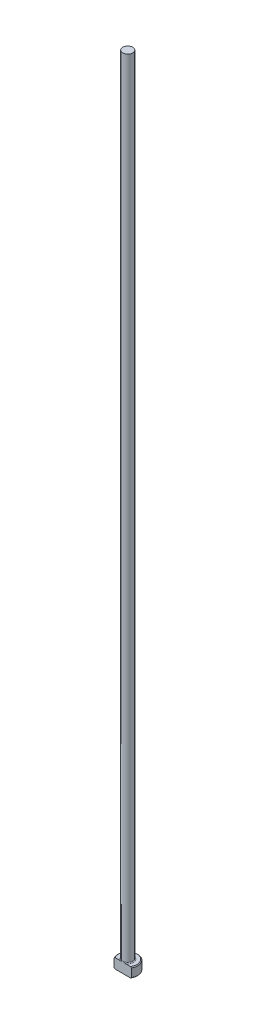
ISO-10303-21;
HEADER;
FILE_DESCRIPTION(('STEP AP214'),'2;1');
FILE_NAME('part.step','',(''),(''),'','','');
FILE_SCHEMA(('AUTOMOTIVE_DESIGN { 1 0 10303 214 1 1 1 1 }'));
ENDSEC;
DATA;
#1=APPLICATION_CONTEXT('core data for automotive mechanical design processes');
#2=APPLICATION_PROTOCOL_DEFINITION('international standard','automotive_design',2000,#1);
#3=PRODUCT_CONTEXT('',#1,'mechanical');
#4=PRODUCT('Part','Part','',(#3));
#5=PRODUCT_RELATED_PRODUCT_CATEGORY('part','',(#4));
#6=PRODUCT_DEFINITION_FORMATION('','',#4);
#7=PRODUCT_DEFINITION_CONTEXT('part definition',#1,'design');
#8=PRODUCT_DEFINITION('design','',#6,#7);
#9=PRODUCT_DEFINITION_SHAPE('','',#8);
#10=(LENGTH_UNIT() NAMED_UNIT(*) SI_UNIT(.MILLI.,.METRE.));
#11=(NAMED_UNIT(*) PLANE_ANGLE_UNIT() SI_UNIT($,.RADIAN.));
#12=(NAMED_UNIT(*) SI_UNIT($,.STERADIAN.) SOLID_ANGLE_UNIT());
#13=UNCERTAINTY_MEASURE_WITH_UNIT(LENGTH_MEASURE(1.E-05),#10,'distance_accuracy_value','');
#14=(GEOMETRIC_REPRESENTATION_CONTEXT(3) GLOBAL_UNCERTAINTY_ASSIGNED_CONTEXT((#13)) GLOBAL_UNIT_ASSIGNED_CONTEXT((#10,
#11,#12)) REPRESENTATION_CONTEXT('',''));
#15=CARTESIAN_POINT('',(0.,0.,0.));
#16=DIRECTION('',(0.,0.,1.));
#17=DIRECTION('',(1.,0.,0.));
#18=AXIS2_PLACEMENT_3D('',#15,#16,#17);
#19=CARTESIAN_POINT('',(0.,0.,0.));
#20=DIRECTION('',(0.,-1.,0.));
#21=DIRECTION('',(0.,0.,-1.));
#22=AXIS2_PLACEMENT_3D('',#19,#20,#21);
#23=PLANE('',#22);
#24=DIRECTION('',(1.,0.,0.));
#25=VECTOR('',#24,1.);
#26=CARTESIAN_POINT('',(-2.74963065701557,0.,1.58749999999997));
#27=LINE('',#26,#25);
#28=CARTESIAN_POINT('',(-2.45195529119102,0.,1.58749999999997));
#29=VERTEX_POINT('',#28);
#30=CARTESIAN_POINT('',(2.45195529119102,0.,1.58749999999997));
#31=VERTEX_POINT('',#30);
#32=EDGE_CURVE('E92',#29,#31,#27,.T.);
#33=ORIENTED_EDGE('',*,*,#32,.F.);
#34=CARTESIAN_POINT('',(0.,0.,0.));
#35=DIRECTION('',(0.,-1.,0.));
#36=DIRECTION('',(0.,0.,-1.));
#37=AXIS2_PLACEMENT_3D('',#34,#35,#36);
#38=CIRCLE('',#37,2.92099999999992);
#39=EDGE_CURVE('E105',#29,#31,#38,.T.);
#40=ORIENTED_EDGE('',*,*,#39,.T.);
#41=EDGE_LOOP('',(#33,#40));
#42=FACE_BOUND('',#41,.T.);
#43=ADVANCED_FACE('F37',(#42),#23,.T.);
#44=CARTESIAN_POINT('',(0.,259.958771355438,0.));
#45=DIRECTION('',(0.,1.,0.));
#46=DIRECTION('',(0.,0.,1.));
#47=AXIS2_PLACEMENT_3D('',#44,#45,#46);
#48=CYLINDRICAL_SURFACE('',#47,3.17499999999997);
#49=DIRECTION('',(0.,-1.,0.));
#50=VECTOR('',#49,1.);
#51=CARTESIAN_POINT('',(-2.74963065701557,254.,1.58749999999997));
#52=LINE('',#51,#50);
#53=CARTESIAN_POINT('',(-2.74963065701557,2.92100000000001,1.58749999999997));
#54=VERTEX_POINT('',#53);
#55=CARTESIAN_POINT('',(-2.74963065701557,0.254000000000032,1.58749999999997));
#56=VERTEX_POINT('',#55);
#57=EDGE_CURVE('E95',#54,#56,#52,.T.);
#58=ORIENTED_EDGE('',*,*,#57,.F.);
#59=CARTESIAN_POINT('',(0.,2.92100000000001,0.));
#60=DIRECTION('',(0.,1.,0.));
#61=DIRECTION('',(0.,0.,1.));
#62=AXIS2_PLACEMENT_3D('',#59,#60,#61);
#63=CIRCLE('',#62,3.17499999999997);
#64=CARTESIAN_POINT('',(2.74963065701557,2.92100000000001,1.58749999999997));
#65=VERTEX_POINT('',#64);
#66=EDGE_CURVE('E109',#54,#65,#63,.F.);
#67=ORIENTED_EDGE('',*,*,#66,.T.);
#68=DIRECTION('',(0.,-1.,0.));
#69=VECTOR('',#68,1.);
#70=CARTESIAN_POINT('',(2.74963065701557,254.,1.58749999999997));
#71=LINE('',#70,#69);
#72=CARTESIAN_POINT('',(2.74963065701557,0.254000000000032,1.58749999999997));
#73=VERTEX_POINT('',#72);
#74=EDGE_CURVE('E187',#65,#73,#71,.T.);
#75=ORIENTED_EDGE('',*,*,#74,.T.);
#76=CARTESIAN_POINT('',(0.,0.254000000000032,0.));
#77=DIRECTION('',(0.,-1.,0.));
#78=DIRECTION('',(0.,0.,-1.));
#79=AXIS2_PLACEMENT_3D('',#76,#77,#78);
#80=CIRCLE('',#79,3.17499999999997);
#81=EDGE_CURVE('E115',#73,#56,#80,.F.);
#82=ORIENTED_EDGE('',*,*,#81,.T.);
#83=EDGE_LOOP('',(#58,#67,#75,#82));
#84=FACE_BOUND('',#83,.T.);
#85=ADVANCED_FACE('F160',(#84),#48,.T.);
#86=CARTESIAN_POINT('',(-3.17499999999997,3.175,0.));
#87=DIRECTION('',(0.,1.,0.));
#88=DIRECTION('',(0.,0.,1.));
#89=AXIS2_PLACEMENT_3D('',#86,#87,#88);
#90=PLANE('',#89);
#91=DIRECTION('',(-1.,0.,0.));
#92=VECTOR('',#91,1.);
#93=CARTESIAN_POINT('',(-3.17499999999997,3.175,1.58749999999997));
#94=LINE('',#93,#92);
#95=CARTESIAN_POINT('',(2.45195529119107,3.175,1.58749999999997));
#96=VERTEX_POINT('',#95);
#97=CARTESIAN_POINT('',(0.933255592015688,3.175,1.58749999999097));
#98=VERTEX_POINT('',#97);
#99=EDGE_CURVE('E58',#96,#98,#94,.T.);
#100=ORIENTED_EDGE('',*,*,#99,.F.);
#101=CARTESIAN_POINT('',(0.,3.175,0.));
#102=DIRECTION('',(0.,1.,0.));
#103=DIRECTION('',(0.,0.,1.));
#104=AXIS2_PLACEMENT_3D('',#101,#102,#103);
#105=CIRCLE('',#104,2.92099999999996);
#106=CARTESIAN_POINT('',(-2.45195529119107,3.175,1.58749999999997));
#107=VERTEX_POINT('',#106);
#108=EDGE_CURVE('E182',#96,#107,#105,.T.);
#109=ORIENTED_EDGE('',*,*,#108,.T.);
#110=CARTESIAN_POINT('',(-0.933255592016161,3.17500000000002,1.58749999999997));
#111=VERTEX_POINT('',#110);
#112=EDGE_CURVE('E140',#111,#107,#94,.T.);
#113=ORIENTED_EDGE('',*,*,#112,.F.);
#114=CARTESIAN_POINT('',(0.,3.175,0.));
#115=DIRECTION('',(0.,1.,0.));
#116=DIRECTION('',(0.,0.,1.));
#117=AXIS2_PLACEMENT_3D('',#114,#115,#116);
#118=CIRCLE('',#117,1.84149999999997);
#119=EDGE_CURVE('E112',#111,#98,#118,.F.);
#120=ORIENTED_EDGE('',*,*,#119,.T.);
#121=EDGE_LOOP('',(#100,#109,#113,#120));
#122=FACE_BOUND('',#121,.T.);
#123=ADVANCED_FACE('F164',(#122),#90,.T.);
#124=CARTESIAN_POINT('',(0.,259.958771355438,0.));
#125=DIRECTION('',(0.,1.,0.));
#126=DIRECTION('',(0.,0.,1.));
#127=AXIS2_PLACEMENT_3D('',#124,#125,#126);
#128=CYLINDRICAL_SURFACE('',#127,1.58749999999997);
#129=CARTESIAN_POINT('',(0.,3.42900000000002,0.));
#130=DIRECTION('',(0.,1.,0.));
#131=DIRECTION('',(0.,0.,1.));
#132=AXIS2_PLACEMENT_3D('',#129,#130,#131);
#133=CIRCLE('',#132,1.58749999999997);
#134=CARTESIAN_POINT('',(0.,3.42900000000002,1.58749999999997));
#135=VERTEX_POINT('',#134);
#136=EDGE_CURVE('E108',#135,#135,#133,.T.);
#137=ORIENTED_EDGE('',*,*,#136,.T.);
#138=EDGE_LOOP('',(#137));
#139=FACE_BOUND('',#138,.T.);
#140=CARTESIAN_POINT('',(0.,254.,0.));
#141=DIRECTION('',(0.,1.,0.));
#142=DIRECTION('',(0.,0.,1.));
#143=AXIS2_PLACEMENT_3D('',#140,#141,#142);
#144=CIRCLE('',#143,1.58749999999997);
#145=CARTESIAN_POINT('',(0.,254.,1.58749999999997));
#146=VERTEX_POINT('',#145);
#147=EDGE_CURVE('E100',#146,#146,#144,.T.);
#148=ORIENTED_EDGE('',*,*,#147,.F.);
#149=EDGE_LOOP('',(#148));
#150=FACE_BOUND('',#149,.T.);
#151=ADVANCED_FACE('F169',(#139,#150),#128,.T.);
#152=CARTESIAN_POINT('',(-1.58749999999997,254.,0.));
#153=DIRECTION('',(0.,1.,0.));
#154=DIRECTION('',(0.,0.,1.));
#155=AXIS2_PLACEMENT_3D('',#152,#153,#154);
#156=PLANE('',#155);
#157=ORIENTED_EDGE('',*,*,#147,.T.);
#158=EDGE_LOOP('',(#157));
#159=FACE_BOUND('',#158,.T.);
#160=ADVANCED_FACE('F127',(#159),#156,.T.);
#161=CARTESIAN_POINT('',(0.,3.17499999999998,0.));
#162=DIRECTION('',(0.,-1.,0.));
#163=DIRECTION('',(0.,0.,-1.));
#164=AXIS2_PLACEMENT_3D('',#161,#162,#163);
#165=CONICAL_SURFACE('',#164,2.92099999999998,0.785398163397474);
#166=CARTESIAN_POINT('',(2.75033065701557,2.9203937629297,1.58749999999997));
#167=CARTESIAN_POINT('',(2.66887796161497,2.99091042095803,1.58749999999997));
#168=CARTESIAN_POINT('',(2.5870598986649,3.0610138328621,1.58749999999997));
#169=CARTESIAN_POINT('',(2.42241022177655,3.20009957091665,1.58749999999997));
#170=CARTESIAN_POINT('',(2.3395781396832,3.26908134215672,1.58749999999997));
#171=CARTESIAN_POINT('',(2.17073968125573,3.40716024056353,1.58749999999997));
#172=CARTESIAN_POINT('',(2.08470440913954,3.47622217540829,1.58749999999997));
#173=CARTESIAN_POINT('',(1.9109988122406,3.61222325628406,1.58749999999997));
#174=CARTESIAN_POINT('',(1.82332890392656,3.67916293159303,1.58749999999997));
#175=CARTESIAN_POINT('',(1.6456922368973,3.81020667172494,1.58749999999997));
#176=CARTESIAN_POINT('',(1.55572245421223,3.87430666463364,1.58749999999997));
#177=CARTESIAN_POINT('',(1.37280394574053,3.99833089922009,1.58749999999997));
#178=CARTESIAN_POINT('',(1.27985285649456,4.05825170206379,1.58749999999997));
#179=CARTESIAN_POINT('',(1.09086561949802,4.17130826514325,1.58749999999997));
#180=CARTESIAN_POINT('',(0.994859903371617,4.22449421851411,1.58749999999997));
#181=CARTESIAN_POINT('',(0.798114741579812,4.32122233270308,1.58749999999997));
#182=CARTESIAN_POINT('',(0.697384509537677,4.36478238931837,1.58749999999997));
#183=CARTESIAN_POINT('',(0.541185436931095,4.41951656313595,1.58749999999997));
#184=CARTESIAN_POINT('',(0.487627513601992,4.43611950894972,1.58749999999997));
#185=CARTESIAN_POINT('',(0.379267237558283,4.46466012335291,1.58749999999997));
#186=CARTESIAN_POINT('',(0.324465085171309,4.47659853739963,1.58749999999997));
#187=CARTESIAN_POINT('',(0.214272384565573,4.49501904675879,1.58749999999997));
#188=CARTESIAN_POINT('',(0.158887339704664,4.50153345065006,1.58749999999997));
#189=CARTESIAN_POINT('',(0.0477364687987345,4.50875028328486,1.58749999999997));
#190=CARTESIAN_POINT('',(-0.00802931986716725,4.5094532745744,1.58749999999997));
#191=CARTESIAN_POINT('',(-0.11937295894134,4.5049916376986,1.58749999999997));
#192=CARTESIAN_POINT('',(-0.174950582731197,4.49982147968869,1.58749999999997));
#193=CARTESIAN_POINT('',(-0.285312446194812,4.48399101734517,1.58749999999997));
#194=CARTESIAN_POINT('',(-0.34009653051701,4.47332965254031,1.58749999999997));
#195=CARTESIAN_POINT('',(-0.448865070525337,4.44711334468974,1.58749999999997));
#196=CARTESIAN_POINT('',(-0.502841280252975,4.43152477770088,1.58749999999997));
#197=CARTESIAN_POINT('',(-0.609429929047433,4.39628553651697,1.58749999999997));
#198=CARTESIAN_POINT('',(-0.662042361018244,4.37663484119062,1.58749999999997));
#199=CARTESIAN_POINT('',(-0.778129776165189,4.32902110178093,1.58749999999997));
#200=CARTESIAN_POINT('',(-0.841245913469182,4.30019026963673,1.58749999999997));
#201=CARTESIAN_POINT('',(-0.965594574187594,4.23868811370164,1.58749999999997));
#202=CARTESIAN_POINT('',(-1.02682597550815,4.20601455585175,1.58749999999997));
#203=CARTESIAN_POINT('',(-1.14774341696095,4.1376901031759,1.58749999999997));
#204=CARTESIAN_POINT('',(-1.20742632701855,4.10203371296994,1.58749999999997));
#205=CARTESIAN_POINT('',(-1.32539130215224,4.02846531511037,1.58749999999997));
#206=CARTESIAN_POINT('',(-1.38367308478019,3.99055285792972,1.58749999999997));
#207=CARTESIAN_POINT('',(-1.55734442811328,3.87382704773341,1.58749999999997));
#208=CARTESIAN_POINT('',(-1.67095842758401,3.79237897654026,1.58749999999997));
#209=CARTESIAN_POINT('',(-1.89475235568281,3.62521862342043,1.58749999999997));
#210=CARTESIAN_POINT('',(-2.00493591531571,3.53951111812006,1.58749999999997));
#211=CARTESIAN_POINT('',(-2.22248693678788,3.36554942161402,1.58749999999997));
#212=CARTESIAN_POINT('',(-2.32986450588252,3.27730782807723,1.58749999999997));
#213=CARTESIAN_POINT('',(-2.48909538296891,3.14389342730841,1.58749999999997));
#214=CARTESIAN_POINT('',(-2.54159338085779,3.09948435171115,1.58749999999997));
#215=CARTESIAN_POINT('',(-2.64622282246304,3.0102412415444,1.58749999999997));
#216=CARTESIAN_POINT('',(-2.69835428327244,2.9654072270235,1.58749999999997));
#217=CARTESIAN_POINT('',(-2.75033065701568,2.92039376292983,1.58749999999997));
#218=B_SPLINE_CURVE_WITH_KNOTS('',3,(#166,#167,#168,#169,#170,#171,#172,#173,#174,#175,#176,
#177,#178,#179,#180,#181,#182,#183,#184,#185,#186,#187,#188,#189,#190,#191,#192,#193,#194,#195,
#196,#197,#198,#199,#200,#201,#202,#203,#204,#205,#206,#207,#208,#209,#210,#211,#212,#213,#214,
#215,#216,#217),.UNSPECIFIED.,.F.,.F.,(4,2,2,2,2,2,2,2,2,2,2,2,2,2,2,2,2,2,2,2,2,2,2,2,2,4),(0.,
0.323216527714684,0.646588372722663,0.9775395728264,1.30840757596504,1.63973560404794,
1.97133312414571,2.30029221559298,2.62863448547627,2.79668277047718,2.96470418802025,
3.1317174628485,3.2987145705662,3.46586904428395,3.63305581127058,3.80140905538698,
3.96976317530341,4.17775353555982,4.3858654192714,4.59436953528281,4.80291533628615,
5.2220964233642,5.64081759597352,6.057730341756,6.26401477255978,6.47028951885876),.UNSPECIFIED.);
#219=EDGE_CURVE('E63',#65,#96,#218,.T.);
#220=ORIENTED_EDGE('',*,*,#219,.F.);
#221=ORIENTED_EDGE('',*,*,#66,.F.);
#222=EDGE_CURVE('E133',#107,#54,#218,.T.);
#223=ORIENTED_EDGE('',*,*,#222,.F.);
#224=ORIENTED_EDGE('',*,*,#108,.F.);
#225=EDGE_LOOP('',(#220,#221,#223,#224));
#226=FACE_BOUND('',#225,.T.);
#227=ADVANCED_FACE('F147',(#226),#165,.T.);
#228=CARTESIAN_POINT('',(0.,0.254000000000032,0.));
#229=DIRECTION('',(0.,1.,0.));
#230=DIRECTION('',(0.,0.,1.));
#231=AXIS2_PLACEMENT_3D('',#228,#229,#230);
#232=CONICAL_SURFACE('',#231,3.17499999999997,0.785398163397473);
#233=CARTESIAN_POINT('',(-2.75033065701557,0.254606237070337,1.58749999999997));
#234=CARTESIAN_POINT('',(-2.66887796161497,0.184089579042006,1.58749999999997));
#235=CARTESIAN_POINT('',(-2.5870598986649,0.113986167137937,1.58749999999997));
#236=CARTESIAN_POINT('',(-2.42241022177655,-0.0250995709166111,1.58749999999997));
#237=CARTESIAN_POINT('',(-2.3395781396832,-0.0940813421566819,1.58749999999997));
#238=CARTESIAN_POINT('',(-2.17073968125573,-0.232160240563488,1.58749999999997));
#239=CARTESIAN_POINT('',(-2.08470440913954,-0.301222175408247,1.58749999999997));
#240=CARTESIAN_POINT('',(-1.9109988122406,-0.437223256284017,1.58749999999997));
#241=CARTESIAN_POINT('',(-1.82332890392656,-0.504162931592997,1.58749999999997));
#242=CARTESIAN_POINT('',(-1.6456922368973,-0.635206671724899,1.58749999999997));
#243=CARTESIAN_POINT('',(-1.55572245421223,-0.699306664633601,1.58749999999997));
#244=CARTESIAN_POINT('',(-1.37280394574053,-0.823330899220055,1.58749999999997));
#245=CARTESIAN_POINT('',(-1.27985285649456,-0.883251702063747,1.58749999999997));
#246=CARTESIAN_POINT('',(-1.09086561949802,-0.996308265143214,1.58749999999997));
#247=CARTESIAN_POINT('',(-0.994859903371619,-1.04949421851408,1.58749999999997));
#248=CARTESIAN_POINT('',(-0.798114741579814,-1.14622233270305,1.58749999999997));
#249=CARTESIAN_POINT('',(-0.697384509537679,-1.18978238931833,1.58749999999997));
#250=CARTESIAN_POINT('',(-0.541185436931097,-1.24451656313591,1.58749999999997));
#251=CARTESIAN_POINT('',(-0.487627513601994,-1.26111950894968,1.58749999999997));
#252=CARTESIAN_POINT('',(-0.379267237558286,-1.28966012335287,1.58749999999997));
#253=CARTESIAN_POINT('',(-0.324465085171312,-1.30159853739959,1.58749999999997));
#254=CARTESIAN_POINT('',(-0.214272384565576,-1.32001904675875,1.58749999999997));
#255=CARTESIAN_POINT('',(-0.158887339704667,-1.32653345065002,1.58749999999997));
#256=CARTESIAN_POINT('',(-0.0477364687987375,-1.33375028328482,1.58749999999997));
#257=CARTESIAN_POINT('',(0.00802931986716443,-1.33445327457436,1.58749999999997));
#258=CARTESIAN_POINT('',(0.119372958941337,-1.32999163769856,1.58749999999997));
#259=CARTESIAN_POINT('',(0.174950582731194,-1.32482147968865,1.58749999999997));
#260=CARTESIAN_POINT('',(0.285312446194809,-1.30899101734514,1.58749999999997));
#261=CARTESIAN_POINT('',(0.340096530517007,-1.29832965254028,1.58749999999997));
#262=CARTESIAN_POINT('',(0.448865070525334,-1.2721133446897,1.58749999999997));
#263=CARTESIAN_POINT('',(0.502841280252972,-1.25652477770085,1.58749999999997));
#264=CARTESIAN_POINT('',(0.60942992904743,-1.22128553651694,1.58749999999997));
#265=CARTESIAN_POINT('',(0.662042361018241,-1.20163484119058,1.58749999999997));
#266=CARTESIAN_POINT('',(0.778129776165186,-1.1540211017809,1.58749999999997));
#267=CARTESIAN_POINT('',(0.841245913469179,-1.12519026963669,1.58749999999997));
#268=CARTESIAN_POINT('',(0.965594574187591,-1.0636881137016,1.58749999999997));
#269=CARTESIAN_POINT('',(1.02682597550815,-1.03101455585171,1.58749999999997));
#270=CARTESIAN_POINT('',(1.14774341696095,-0.962690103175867,1.58749999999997));
#271=CARTESIAN_POINT('',(1.20742632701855,-0.927033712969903,1.58749999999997));
#272=CARTESIAN_POINT('',(1.32539130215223,-0.853465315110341,1.58749999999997));
#273=CARTESIAN_POINT('',(1.38367308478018,-0.815552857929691,1.58749999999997));
#274=CARTESIAN_POINT('',(1.55734442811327,-0.698827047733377,1.58749999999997));
#275=CARTESIAN_POINT('',(1.67095842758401,-0.617378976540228,1.58749999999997));
#276=CARTESIAN_POINT('',(1.8947523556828,-0.450218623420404,1.58749999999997));
#277=CARTESIAN_POINT('',(2.0049359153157,-0.364511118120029,1.58749999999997));
#278=CARTESIAN_POINT('',(2.22248693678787,-0.190549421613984,1.58749999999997));
#279=CARTESIAN_POINT('',(2.32986450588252,-0.102307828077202,1.58749999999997));
#280=CARTESIAN_POINT('',(2.4890953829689,0.0311065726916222,1.58749999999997));
#281=CARTESIAN_POINT('',(2.54159338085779,0.0755156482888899,1.58749999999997));
#282=CARTESIAN_POINT('',(2.64622282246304,0.164758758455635,1.58749999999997));
#283=CARTESIAN_POINT('',(2.69835428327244,0.209592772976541,1.58749999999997));
#284=CARTESIAN_POINT('',(2.75033065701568,0.25460623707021,1.58749999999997));
#285=B_SPLINE_CURVE_WITH_KNOTS('',3,(#233,#234,#235,#236,#237,#238,#239,#240,#241,#242,#243,
#244,#245,#246,#247,#248,#249,#250,#251,#252,#253,#254,#255,#256,#257,#258,#259,#260,#261,#262,
#263,#264,#265,#266,#267,#268,#269,#270,#271,#272,#273,#274,#275,#276,#277,#278,#279,#280,#281,
#282,#283,#284),.UNSPECIFIED.,.F.,.F.,(4,2,2,2,2,2,2,2,2,2,2,2,2,2,2,2,2,2,2,2,2,2,2,2,2,4),(0.,
0.323216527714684,0.646588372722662,0.9775395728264,1.30840757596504,1.63973560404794,
1.97133312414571,2.30029221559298,2.62863448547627,2.79668277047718,2.96470418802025,
3.1317174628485,3.2987145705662,3.46586904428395,3.63305581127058,3.80140905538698,
3.96976317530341,4.17775353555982,4.3858654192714,4.59436953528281,4.80291533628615,
5.22209642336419,5.64081759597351,6.057730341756,6.26401477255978,6.47028951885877),.UNSPECIFIED.);
#286=EDGE_CURVE('E89',#56,#29,#285,.T.);
#287=ORIENTED_EDGE('',*,*,#286,.F.);
#288=ORIENTED_EDGE('',*,*,#81,.F.);
#289=EDGE_CURVE('E101',#31,#73,#285,.T.);
#290=ORIENTED_EDGE('',*,*,#289,.F.);
#291=ORIENTED_EDGE('',*,*,#39,.F.);
#292=EDGE_LOOP('',(#287,#288,#290,#291));
#293=FACE_BOUND('',#292,.T.);
#294=ADVANCED_FACE('F107',(#293),#232,.T.);
#295=CARTESIAN_POINT('',(0.,3.42900000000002,0.));
#296=DIRECTION('',(0.,1.,0.));
#297=DIRECTION('',(0.,0.,1.));
#298=AXIS2_PLACEMENT_3D('',#295,#296,#297);
#299=TOROIDAL_SURFACE('',#298,1.84149999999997,0.254);
#300=ORIENTED_EDGE('',*,*,#119,.F.);
#301=CARTESIAN_POINT('',(0.,3.42900000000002,1.58749999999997));
#302=CARTESIAN_POINT('',(-1.92208523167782E-10,3.42900057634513,1.58749999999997));
#303=CARTESIAN_POINT('',(-1.22611620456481E-07,3.42900115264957,1.58749999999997));
#304=CARTESIAN_POINT('',(-5.09676375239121E-07,3.4290022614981,1.58749999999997));
#305=CARTESIAN_POINT('',(-7.78176339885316E-07,3.42900279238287,1.58749999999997));
#306=CARTESIAN_POINT('',(-1.4230727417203E-06,3.42900385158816,1.58749999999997));
#307=CARTESIAN_POINT('',(-1.80713868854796E-06,3.42900437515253,1.58749999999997));
#308=CARTESIAN_POINT('',(-2.63494848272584E-06,3.42900536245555,1.58749999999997));
#309=CARTESIAN_POINT('',(-3.07814758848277E-06,3.42900582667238,1.58749999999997));
#310=CARTESIAN_POINT('',(-4.66897360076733E-06,3.42900738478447,1.58749999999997));
#311=CARTESIAN_POINT('',(-5.89404911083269E-06,3.42900840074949,1.58749999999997));
#312=CARTESIAN_POINT('',(-8.42427514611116E-06,3.42901020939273,1.58749999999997));
#313=CARTESIAN_POINT('',(-9.72480578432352E-06,3.4290110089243,1.58749999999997));
#314=CARTESIAN_POINT('',(-1.48060602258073E-05,3.42901401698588,1.58749999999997));
#315=CARTESIAN_POINT('',(-1.86838281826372E-05,3.4290160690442,1.58749999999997));
#316=CARTESIAN_POINT('',(-2.632611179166E-05,3.42901942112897,1.58749999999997));
#317=CARTESIAN_POINT('',(-3.00687417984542E-05,3.42902077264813,1.58749999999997));
#318=CARTESIAN_POINT('',(-4.60276299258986E-05,3.42902652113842,1.58749999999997));
#319=CARTESIAN_POINT('',(-5.82470198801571E-05,3.42903088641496,1.58749999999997));
#320=CARTESIAN_POINT('',(-8.11070097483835E-05,3.42903788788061,1.58749999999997));
#321=CARTESIAN_POINT('',(-9.16953114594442E-05,3.42904068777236,1.58749999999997));
#322=CARTESIAN_POINT('',(-0.000168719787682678,3.4290628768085,1.58749999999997));
#323=CARTESIAN_POINT('',(-0.000232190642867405,3.42909118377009,1.58749999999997));
#324=CARTESIAN_POINT('',(-0.000479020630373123,3.42919723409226,1.58749999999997));
#325=CARTESIAN_POINT('',(-0.000664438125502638,3.42926834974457,1.58749999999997));
#326=CARTESIAN_POINT('',(-0.00138448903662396,3.42954862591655,1.58749999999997));
#327=CARTESIAN_POINT('',(-0.0019170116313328,3.42976473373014,1.58749999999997));
#328=CARTESIAN_POINT('',(-0.00409774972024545,3.43064550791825,1.58749999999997));
#329=CARTESIAN_POINT('',(-0.00574830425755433,3.43130231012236,1.58749999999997));
#330=CARTESIAN_POINT('',(-0.0289985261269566,3.44055947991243,1.58749999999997));
#331=CARTESIAN_POINT('',(-0.0505816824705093,3.4492167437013,1.58749999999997));
#332=CARTESIAN_POINT('',(-0.0929947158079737,3.46610702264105,1.58749999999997));
#333=CARTESIAN_POINT('',(-0.113823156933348,3.47434394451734,1.58749999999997));
#334=CARTESIAN_POINT('',(-0.157956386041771,3.49164606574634,1.58749999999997));
#335=CARTESIAN_POINT('',(-0.181267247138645,3.50069608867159,1.58749999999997));
#336=CARTESIAN_POINT('',(-0.228222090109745,3.51863224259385,1.58749999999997));
#337=CARTESIAN_POINT('',(-0.251867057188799,3.52751579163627,1.58749999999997));
#338=CARTESIAN_POINT('',(-0.310512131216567,3.54905503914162,1.58749999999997));
#339=CARTESIAN_POINT('',(-0.345588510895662,3.56150550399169,1.58749999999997));
#340=CARTESIAN_POINT('',(-0.415278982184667,3.58503024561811,1.58749999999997));
#341=CARTESIAN_POINT('',(-0.449884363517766,3.59613012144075,1.58749999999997));
#342=CARTESIAN_POINT('',(-0.524471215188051,3.61841679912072,1.58749999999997));
#343=CARTESIAN_POINT('',(-0.564517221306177,3.62939137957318,1.58749999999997));
#344=CARTESIAN_POINT('',(-0.64552942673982,3.6489746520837,1.58749999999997));
#345=CARTESIAN_POINT('',(-0.686500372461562,3.65756417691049,1.58749999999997));
#346=CARTESIAN_POINT('',(-0.771546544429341,3.67188287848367,1.58749999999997));
#347=CARTESIAN_POINT('',(-0.815658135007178,3.67740449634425,1.58749999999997));
#348=CARTESIAN_POINT('',(-0.904117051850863,3.68344603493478,1.58749999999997));
#349=CARTESIAN_POINT('',(-0.948462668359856,3.68398638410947,1.58749999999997));
#350=CARTESIAN_POINT('',(-1.02531896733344,3.67901051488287,1.58749999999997));
#351=CARTESIAN_POINT('',(-1.05792141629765,3.67502604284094,1.58749999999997));
#352=CARTESIAN_POINT('',(-1.12184393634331,3.6623083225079,1.58749999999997));
#353=CARTESIAN_POINT('',(-1.15317534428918,3.65363950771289,1.58749999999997));
#354=CARTESIAN_POINT('',(-1.19946468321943,3.63563847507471,1.58749999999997));
#355=CARTESIAN_POINT('',(-1.2152678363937,3.62848492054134,1.58749999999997));
#356=CARTESIAN_POINT('',(-1.24583726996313,3.61212937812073,1.58749999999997));
#357=CARTESIAN_POINT('',(-1.26060215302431,3.60292469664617,1.58749999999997));
#358=CARTESIAN_POINT('',(-1.28575815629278,3.58421518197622,1.58749999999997));
#359=CARTESIAN_POINT('',(-1.29644383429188,3.57510998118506,1.58749999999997));
#360=CARTESIAN_POINT('',(-1.31623154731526,3.55531539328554,1.58749999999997));
#361=CARTESIAN_POINT('',(-1.32533681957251,3.54462932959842,1.58749999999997));
#362=CARTESIAN_POINT('',(-1.33941140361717,3.52450022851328,1.58749999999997));
#363=CARTESIAN_POINT('',(-1.34484814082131,3.51538553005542,1.58749999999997));
#364=CARTESIAN_POINT('',(-1.35416329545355,3.49638544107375,1.58749999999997));
#365=CARTESIAN_POINT('',(-1.35804267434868,3.48650053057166,1.58749999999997));
#366=CARTESIAN_POINT('',(-1.36398436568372,3.46611321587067,1.58749999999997));
#367=CARTESIAN_POINT('',(-1.36603350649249,3.45560690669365,1.58749999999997));
#368=CARTESIAN_POINT('',(-1.3680840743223,3.43439627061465,1.58749999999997));
#369=CARTESIAN_POINT('',(-1.36808648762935,3.42369204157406,1.58749999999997));
#370=CARTESIAN_POINT('',(-1.36616208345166,3.40366716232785,1.58749999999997));
#371=CARTESIAN_POINT('',(-1.36444960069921,3.39432493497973,1.58749999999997));
#372=CARTESIAN_POINT('',(-1.35953338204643,3.37604480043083,1.58749999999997));
#373=CARTESIAN_POINT('',(-1.3563294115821,3.36710695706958,1.58749999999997));
#374=CARTESIAN_POINT('',(-1.34848006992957,3.34949697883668,1.58749999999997));
#375=CARTESIAN_POINT('',(-1.34378578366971,3.34084688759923,1.58749999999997));
#376=CARTESIAN_POINT('',(-1.33324445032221,3.32428742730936,1.58749999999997));
#377=CARTESIAN_POINT('',(-1.32739692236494,3.3163783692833,1.58749999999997));
#378=CARTESIAN_POINT('',(-1.3110730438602,3.29692878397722,1.58749999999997));
#379=CARTESIAN_POINT('',(-1.29989286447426,3.28597778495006,1.58749999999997));
#380=CARTESIAN_POINT('',(-1.27593566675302,3.26597490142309,1.58749999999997));
#381=CARTESIAN_POINT('',(-1.26315370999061,3.25692913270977,1.58749999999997));
#382=CARTESIAN_POINT('',(-1.2293073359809,3.23613976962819,1.58749999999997));
#383=CARTESIAN_POINT('',(-1.20751096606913,3.225594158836,1.58749999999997));
#384=CARTESIAN_POINT('',(-1.16266144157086,3.20795356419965,1.58749999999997));
#385=CARTESIAN_POINT('',(-1.13960937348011,3.20085564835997,1.58749999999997));
#386=CARTESIAN_POINT('',(-1.07603916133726,3.18534571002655,1.58749999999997));
#387=CARTESIAN_POINT('',(-1.03486686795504,3.17965078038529,1.58749999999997));
#388=CARTESIAN_POINT('',(-0.951558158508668,3.1741711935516,1.58749999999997));
#389=CARTESIAN_POINT('',(-0.909417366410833,3.17449023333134,1.58749999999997));
#390=CARTESIAN_POINT('',(-0.811383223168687,3.18054602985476,1.58749999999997));
#391=CARTESIAN_POINT('',(-0.755610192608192,3.18806126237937,1.58749999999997));
#392=CARTESIAN_POINT('',(-0.644937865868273,3.20866626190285,1.58749999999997));
#393=CARTESIAN_POINT('',(-0.590043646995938,3.22178102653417,1.58749999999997));
#394=CARTESIAN_POINT('',(-0.485757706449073,3.25059077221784,1.58749999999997));
#395=CARTESIAN_POINT('',(-0.436281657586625,3.26598903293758,1.58749999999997));
#396=CARTESIAN_POINT('',(-0.33855196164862,3.29877502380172,1.58749999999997));
#397=CARTESIAN_POINT('',(-0.290291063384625,3.31614156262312,1.58749999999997));
#398=CARTESIAN_POINT('',(-0.225557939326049,3.34039762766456,1.58749999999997));
#399=CARTESIAN_POINT('',(-0.208874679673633,3.34673586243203,1.58749999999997));
#400=CARTESIAN_POINT('',(-0.17512392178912,3.3596995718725,1.58749999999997));
#401=CARTESIAN_POINT('',(-0.158057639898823,3.36632823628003,1.58749999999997));
#402=CARTESIAN_POINT('',(-0.117638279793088,3.38214476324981,1.58749999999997));
#403=CARTESIAN_POINT('',(-0.0943002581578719,3.39137029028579,1.58749999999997));
#404=CARTESIAN_POINT('',(-0.0497824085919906,3.40910304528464,1.58749999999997));
#405=CARTESIAN_POINT('',(-0.0285986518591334,3.41759960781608,1.58749999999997));
#406=CARTESIAN_POINT('',(-0.00575168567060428,3.42669635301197,1.58749999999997));
#407=CARTESIAN_POINT('',(-0.00410451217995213,3.42735181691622,1.58749999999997));
#408=CARTESIAN_POINT('',(-0.00192459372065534,3.42823223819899,1.58749999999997));
#409=CARTESIAN_POINT('',(-0.00138952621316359,3.42844937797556,1.58749999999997));
#410=CARTESIAN_POINT('',(-0.000666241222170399,3.42873091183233,1.58749999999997));
#411=CARTESIAN_POINT('',(-0.000480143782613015,3.4288022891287,1.58749999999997));
#412=CARTESIAN_POINT('',(-0.00023251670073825,3.42890868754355,1.58749999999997));
#413=CARTESIAN_POINT('',(-0.000168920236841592,3.42893705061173,1.58749999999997));
#414=CARTESIAN_POINT('',(-9.17527159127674E-05,3.42895927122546,1.58749999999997));
#415=CARTESIAN_POINT('',(-8.11550290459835E-05,3.42896207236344,1.58749999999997));
#416=CARTESIAN_POINT('',(-5.82743946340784E-05,3.42896908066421,1.58749999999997));
#417=CARTESIAN_POINT('',(-4.60439999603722E-05,3.42897345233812,1.58749999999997));
#418=CARTESIAN_POINT('',(-3.00727680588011E-05,3.42897920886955,1.58749999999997));
#419=CARTESIAN_POINT('',(-2.63286806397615E-05,3.42898056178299,1.58749999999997));
#420=CARTESIAN_POINT('',(-1.8683652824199E-05,3.4289839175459,1.58749999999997));
#421=CARTESIAN_POINT('',(-1.48046516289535E-05,3.42898597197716,1.58749999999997));
#422=CARTESIAN_POINT('',(-9.72223935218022E-06,3.42898898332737,1.58749999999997));
#423=CARTESIAN_POINT('',(-8.42159641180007E-06,3.42898978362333,1.58749999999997));
#424=CARTESIAN_POINT('',(-5.89129722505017E-06,3.42899159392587,1.58749999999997));
#425=CARTESIAN_POINT('',(-4.66626861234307E-06,3.42899261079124,1.58749999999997));
#426=CARTESIAN_POINT('',(-3.07568799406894E-06,3.42899417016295,1.58749999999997));
#427=CARTESIAN_POINT('',(-2.6325956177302E-06,3.42899463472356,1.58749999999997));
#428=CARTESIAN_POINT('',(-1.80506082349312E-06,3.42899562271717,1.58749999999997));
#429=CARTESIAN_POINT('',(-1.42116385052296E-06,3.42899614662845,1.58749999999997));
#430=CARTESIAN_POINT('',(-7.76675622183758E-07,3.42899720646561,1.58749999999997));
#431=CARTESIAN_POINT('',(-5.08406471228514E-07,3.42899773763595,1.58749999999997));
#432=CARTESIAN_POINT('',(-1.21901879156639E-07,3.42899884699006,1.58749999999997));
#433=CARTESIAN_POINT('',(1.92255053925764E-10,3.42899942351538,1.58749999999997));
#434=CARTESIAN_POINT('',(0.,3.42900000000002,1.58749999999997));
#435=B_SPLINE_CURVE_WITH_KNOTS('',3,(#301,#302,#303,#304,#305,#306,#307,#308,#309,#310,#311,
#312,#313,#314,#315,#316,#317,#318,#319,#320,#321,#322,#323,#324,#325,#326,#327,#328,#329,#330,
#331,#332,#333,#334,#335,#336,#337,#338,#339,#340,#341,#342,#343,#344,#345,#346,#347,#348,#349,
#350,#351,#352,#353,#354,#355,#356,#357,#358,#359,#360,#361,#362,#363,#364,#365,#366,#367,#368,
#369,#370,#371,#372,#373,#374,#375,#376,#377,#378,#379,#380,#381,#382,#383,#384,#385,#386,#387,
#388,#389,#390,#391,#392,#393,#394,#395,#396,#397,#398,#399,#400,#401,#402,#403,#404,#405,#406,
#407,#408,#409,#410,#411,#412,#413,#414,#415,#416,#417,#418,#419,#420,#421,#422,#423,#424,#425,
#426,#427,#428,#429,#430,#431,#432,#433,#434),.UNSPECIFIED.,.T.,.F.,(4,2,2,2,2,2,2,2,2,2,2,2,2,
2,2,2,2,2,2,2,2,2,2,2,2,2,2,2,2,2,2,2,2,2,2,2,2,2,2,2,2,2,2,2,2,2,2,2,2,2,2,2,2,2,2,2,2,2,2,2,2,
2,2,2,2,2,4),(0.,1.7281546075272E-06,3.50429259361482E-06,5.44431009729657E-06,
7.3675525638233E-06,1.21190897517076E-05,1.66953776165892E-05,2.98160401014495E-05,
4.17409565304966E-05,8.06604753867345E-05,0.000113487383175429,0.000321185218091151,
0.000917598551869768,0.00264089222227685,0.0079710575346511,0.0777276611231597,
0.144923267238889,0.21993959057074,0.295714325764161,0.407362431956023,0.516367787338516,
0.640878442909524,0.766362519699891,0.899536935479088,1.03216495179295,1.13045740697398,
1.22743103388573,1.27935899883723,1.33135556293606,1.37333248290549,1.41522237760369,
1.44693946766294,1.47863694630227,1.51056074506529,1.54246916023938,1.57083210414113,
1.59919951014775,1.62861579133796,1.65804436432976,1.70472658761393,1.75155645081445,
1.82378709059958,1.89595619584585,2.01995471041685,2.14609321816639,2.31447224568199,
2.4836109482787,2.6389891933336,2.79283011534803,2.84637031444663,2.90129461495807,
2.97658236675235,3.04504771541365,3.05036697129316,3.05209849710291,3.05269709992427,
3.05290520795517,3.05293806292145,3.05297701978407,3.05298895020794,3.05300207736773,
3.05300665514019,3.05301140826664,3.05301333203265,3.05301527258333,3.053017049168,
3.05301877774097),.UNSPECIFIED.);
#436=EDGE_CURVE('E11',#111,#135,#435,.T.);
#437=ORIENTED_EDGE('',*,*,#436,.T.);
#438=ORIENTED_EDGE('',*,*,#136,.F.);
#439=CARTESIAN_POINT('',(0.,3.42900000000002,1.58749999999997));
#440=CARTESIAN_POINT('',(1.9220858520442E-10,3.42899942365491,1.58749999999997));
#441=CARTESIAN_POINT('',(1.2261162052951E-07,3.42899884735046,1.58749999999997));
#442=CARTESIAN_POINT('',(5.09676375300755E-07,3.42899773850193,1.58749999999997));
#443=CARTESIAN_POINT('',(7.78176339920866E-07,3.42899720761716,1.58749999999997));
#444=CARTESIAN_POINT('',(1.42307274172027E-06,3.42899614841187,1.58749999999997));
#445=CARTESIAN_POINT('',(1.80713868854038E-06,3.4289956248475,1.58749999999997));
#446=CARTESIAN_POINT('',(2.63494848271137E-06,3.42899463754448,1.58749999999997));
#447=CARTESIAN_POINT('',(3.07814758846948E-06,3.42899417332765,1.58749999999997));
#448=CARTESIAN_POINT('',(4.66897360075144E-06,3.42899261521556,1.58749999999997));
#449=CARTESIAN_POINT('',(5.89404911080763E-06,3.42899159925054,1.58749999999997));
#450=CARTESIAN_POINT('',(8.42427514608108E-06,3.4289897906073,1.58749999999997));
#451=CARTESIAN_POINT('',(9.7248057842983E-06,3.42898899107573,1.58749999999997));
#452=CARTESIAN_POINT('',(1.48060602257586E-05,3.42898598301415,1.58749999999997));
#453=CARTESIAN_POINT('',(1.86838281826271E-05,3.42898393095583,1.58749999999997));
#454=CARTESIAN_POINT('',(2.63261117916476E-05,3.42898057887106,1.58749999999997));
#455=CARTESIAN_POINT('',(3.00687417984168E-05,3.4289792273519,1.58749999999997));
#456=CARTESIAN_POINT('',(4.60276299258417E-05,3.42897347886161,1.58749999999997));
#457=CARTESIAN_POINT('',(5.82470198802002E-05,3.42896911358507,1.58749999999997));
#458=CARTESIAN_POINT('',(8.11070097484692E-05,3.42896211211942,1.58749999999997));
#459=CARTESIAN_POINT('',(9.16953114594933E-05,3.42895931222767,1.58749999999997));
#460=CARTESIAN_POINT('',(0.000168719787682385,3.42893712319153,1.58749999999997));
#461=CARTESIAN_POINT('',(0.000232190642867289,3.42890881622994,1.58749999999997));
#462=CARTESIAN_POINT('',(0.000479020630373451,3.42880276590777,1.58749999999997));
#463=CARTESIAN_POINT('',(0.000664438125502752,3.42873165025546,1.58749999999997));
#464=CARTESIAN_POINT('',(0.00138448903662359,3.42845137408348,1.58749999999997));
#465=CARTESIAN_POINT('',(0.00191701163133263,3.42823526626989,1.58749999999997));
#466=CARTESIAN_POINT('',(0.00409774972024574,3.42735449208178,1.58749999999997));
#467=CARTESIAN_POINT('',(0.00574830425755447,3.42669768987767,1.58749999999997));
#468=CARTESIAN_POINT('',(0.0289985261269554,3.4174405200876,1.58749999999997));
#469=CARTESIAN_POINT('',(0.0505816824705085,3.40878325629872,1.58749999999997));
#470=CARTESIAN_POINT('',(0.0929947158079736,3.39189297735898,1.58749999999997));
#471=CARTESIAN_POINT('',(0.113823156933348,3.38365605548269,1.58749999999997));
#472=CARTESIAN_POINT('',(0.157956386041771,3.36635393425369,1.58749999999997));
#473=CARTESIAN_POINT('',(0.181267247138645,3.35730391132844,1.58749999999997));
#474=CARTESIAN_POINT('',(0.228222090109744,3.33936775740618,1.58749999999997));
#475=CARTESIAN_POINT('',(0.251867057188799,3.33048420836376,1.58749999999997));
#476=CARTESIAN_POINT('',(0.310512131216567,3.30894496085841,1.58749999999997));
#477=CARTESIAN_POINT('',(0.345588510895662,3.29649449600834,1.58749999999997));
#478=CARTESIAN_POINT('',(0.415278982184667,3.27296975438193,1.58749999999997));
#479=CARTESIAN_POINT('',(0.449884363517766,3.26186987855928,1.58749999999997));
#480=CARTESIAN_POINT('',(0.524471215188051,3.23958320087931,1.58749999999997));
#481=CARTESIAN_POINT('',(0.564517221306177,3.22860862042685,1.58749999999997));
#482=CARTESIAN_POINT('',(0.64552942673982,3.20902534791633,1.58749999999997));
#483=CARTESIAN_POINT('',(0.686500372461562,3.20043582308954,1.58749999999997));
#484=CARTESIAN_POINT('',(0.771546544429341,3.18611712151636,1.58749999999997));
#485=CARTESIAN_POINT('',(0.815658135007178,3.18059550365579,1.58749999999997));
#486=CARTESIAN_POINT('',(0.904117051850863,3.17455396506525,1.58749999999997));
#487=CARTESIAN_POINT('',(0.948462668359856,3.17401361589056,1.58749999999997));
#488=CARTESIAN_POINT('',(1.02531896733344,3.17898948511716,1.58749999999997));
#489=CARTESIAN_POINT('',(1.05792141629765,3.18297395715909,1.58749999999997));
#490=CARTESIAN_POINT('',(1.12184393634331,3.19569167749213,1.58749999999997));
#491=CARTESIAN_POINT('',(1.15317534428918,3.20436049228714,1.58749999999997));
#492=CARTESIAN_POINT('',(1.19946468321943,3.22236152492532,1.58749999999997));
#493=CARTESIAN_POINT('',(1.2152678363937,3.22951507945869,1.58749999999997));
#494=CARTESIAN_POINT('',(1.24583726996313,3.2458706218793,1.58749999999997));
#495=CARTESIAN_POINT('',(1.26060215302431,3.25507530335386,1.58749999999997));
#496=CARTESIAN_POINT('',(1.28575815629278,3.27378481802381,1.58749999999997));
#497=CARTESIAN_POINT('',(1.29644383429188,3.28289001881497,1.58749999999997));
#498=CARTESIAN_POINT('',(1.31623154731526,3.30268460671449,1.58749999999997));
#499=CARTESIAN_POINT('',(1.32533681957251,3.31337067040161,1.58749999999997));
#500=CARTESIAN_POINT('',(1.33941140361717,3.33349977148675,1.58749999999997));
#501=CARTESIAN_POINT('',(1.34484814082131,3.34261446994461,1.58749999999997));
#502=CARTESIAN_POINT('',(1.35416329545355,3.36161455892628,1.58749999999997));
#503=CARTESIAN_POINT('',(1.35804267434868,3.37149946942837,1.58749999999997));
#504=CARTESIAN_POINT('',(1.36398436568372,3.39188678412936,1.58749999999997));
#505=CARTESIAN_POINT('',(1.36603350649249,3.40239309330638,1.58749999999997));
#506=CARTESIAN_POINT('',(1.3680840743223,3.42360372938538,1.58749999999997));
#507=CARTESIAN_POINT('',(1.36808648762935,3.43430795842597,1.58749999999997));
#508=CARTESIAN_POINT('',(1.36616208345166,3.45433283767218,1.58749999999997));
#509=CARTESIAN_POINT('',(1.36444960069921,3.4636750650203,1.58749999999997));
#510=CARTESIAN_POINT('',(1.35953338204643,3.4819551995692,1.58749999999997));
#511=CARTESIAN_POINT('',(1.3563294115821,3.49089304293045,1.58749999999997));
#512=CARTESIAN_POINT('',(1.34848006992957,3.50850302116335,1.58749999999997));
#513=CARTESIAN_POINT('',(1.34378578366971,3.5171531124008,1.58749999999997));
#514=CARTESIAN_POINT('',(1.33324445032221,3.53371257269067,1.58749999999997));
#515=CARTESIAN_POINT('',(1.32739692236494,3.54162163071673,1.58749999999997));
#516=CARTESIAN_POINT('',(1.3110730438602,3.56107121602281,1.58749999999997));
#517=CARTESIAN_POINT('',(1.29989286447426,3.57202221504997,1.58749999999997));
#518=CARTESIAN_POINT('',(1.27593566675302,3.59202509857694,1.58749999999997));
#519=CARTESIAN_POINT('',(1.26315370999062,3.60107086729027,1.58749999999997));
#520=CARTESIAN_POINT('',(1.2293073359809,3.62186023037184,1.58749999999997));
#521=CARTESIAN_POINT('',(1.20751096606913,3.63240584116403,1.58749999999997));
#522=CARTESIAN_POINT('',(1.16266144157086,3.65004643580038,1.58749999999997));
#523=CARTESIAN_POINT('',(1.13960937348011,3.65714435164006,1.58749999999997));
#524=CARTESIAN_POINT('',(1.07603916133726,3.67265428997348,1.58749999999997));
#525=CARTESIAN_POINT('',(1.03486686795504,3.67834921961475,1.58749999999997));
#526=CARTESIAN_POINT('',(0.951558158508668,3.68382880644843,1.58749999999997));
#527=CARTESIAN_POINT('',(0.909417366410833,3.68350976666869,1.58749999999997));
#528=CARTESIAN_POINT('',(0.811383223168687,3.67745397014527,1.58749999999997));
#529=CARTESIAN_POINT('',(0.755610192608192,3.66993873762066,1.58749999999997));
#530=CARTESIAN_POINT('',(0.644937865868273,3.64933373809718,1.58749999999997));
#531=CARTESIAN_POINT('',(0.590043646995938,3.63621897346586,1.58749999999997));
#532=CARTESIAN_POINT('',(0.485757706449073,3.60740922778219,1.58749999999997));
#533=CARTESIAN_POINT('',(0.436281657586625,3.59201096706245,1.58749999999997));
#534=CARTESIAN_POINT('',(0.33855196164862,3.55922497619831,1.58749999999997));
#535=CARTESIAN_POINT('',(0.290291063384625,3.54185843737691,1.58749999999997));
#536=CARTESIAN_POINT('',(0.225557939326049,3.51760237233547,1.58749999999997));
#537=CARTESIAN_POINT('',(0.208874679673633,3.511264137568,1.58749999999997));
#538=CARTESIAN_POINT('',(0.17512392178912,3.49830042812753,1.58749999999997));
#539=CARTESIAN_POINT('',(0.158057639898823,3.49167176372,1.58749999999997));
#540=CARTESIAN_POINT('',(0.117638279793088,3.47585523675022,1.58749999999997));
#541=CARTESIAN_POINT('',(0.0943002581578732,3.46662970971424,1.58749999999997));
#542=CARTESIAN_POINT('',(0.0497824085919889,3.4488969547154,1.58749999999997));
#543=CARTESIAN_POINT('',(0.0285986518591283,3.44040039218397,1.58749999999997));
#544=CARTESIAN_POINT('',(0.00575168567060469,3.43130364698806,1.58749999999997));
#545=CARTESIAN_POINT('',(0.00410451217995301,3.43064818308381,1.58749999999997));
#546=CARTESIAN_POINT('',(0.00192459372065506,3.42976776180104,1.58749999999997));
#547=CARTESIAN_POINT('',(0.00138952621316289,3.42955062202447,1.58749999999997));
#548=CARTESIAN_POINT('',(0.000666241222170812,3.4292690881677,1.58749999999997));
#549=CARTESIAN_POINT('',(0.00048014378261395,3.42919771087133,1.58749999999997));
#550=CARTESIAN_POINT('',(0.000232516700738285,3.42909131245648,1.58749999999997));
#551=CARTESIAN_POINT('',(0.000168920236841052,3.4290629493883,1.58749999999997));
#552=CARTESIAN_POINT('',(9.17527159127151E-05,3.42904072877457,1.58749999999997));
#553=CARTESIAN_POINT('',(8.11550290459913E-05,3.42903792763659,1.58749999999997));
#554=CARTESIAN_POINT('',(5.82743946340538E-05,3.42903091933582,1.58749999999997));
#555=CARTESIAN_POINT('',(4.6043999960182E-05,3.42902654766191,1.58749999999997));
#556=CARTESIAN_POINT('',(3.00727680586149E-05,3.42902079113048,1.58749999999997));
#557=CARTESIAN_POINT('',(2.63286806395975E-05,3.42901943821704,1.58749999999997));
#558=CARTESIAN_POINT('',(1.86836528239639E-05,3.42901608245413,1.58749999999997));
#559=CARTESIAN_POINT('',(1.4804651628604E-05,3.42901402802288,1.58749999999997));
#560=CARTESIAN_POINT('',(9.72223935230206E-06,3.42901101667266,1.58749999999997));
#561=CARTESIAN_POINT('',(8.42159641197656E-06,3.4290102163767,1.58749999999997));
#562=CARTESIAN_POINT('',(5.89129722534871E-06,3.42900840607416,1.58749999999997));
#563=CARTESIAN_POINT('',(4.66626861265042E-06,3.42900738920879,1.58749999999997));
#564=CARTESIAN_POINT('',(3.07568799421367E-06,3.42900582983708,1.58749999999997));
#565=CARTESIAN_POINT('',(2.63259561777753E-06,3.42900536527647,1.58749999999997));
#566=CARTESIAN_POINT('',(1.80506082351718E-06,3.42900437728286,1.58749999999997));
#567=CARTESIAN_POINT('',(1.42116385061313E-06,3.42900385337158,1.58749999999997));
#568=CARTESIAN_POINT('',(7.76675622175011E-07,3.42900279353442,1.58749999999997));
#569=CARTESIAN_POINT('',(5.08406471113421E-07,3.42900226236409,1.58749999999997));
#570=CARTESIAN_POINT('',(1.2190187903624E-07,3.42900115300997,1.58749999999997));
#571=CARTESIAN_POINT('',(-1.92255116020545E-10,3.42900057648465,1.58749999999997));
#572=CARTESIAN_POINT('',(0.,3.42900000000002,1.58749999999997));
#573=B_SPLINE_CURVE_WITH_KNOTS('',3,(#439,#440,#441,#442,#443,#444,#445,#446,#447,#448,#449,
#450,#451,#452,#453,#454,#455,#456,#457,#458,#459,#460,#461,#462,#463,#464,#465,#466,#467,#468,
#469,#470,#471,#472,#473,#474,#475,#476,#477,#478,#479,#480,#481,#482,#483,#484,#485,#486,#487,
#488,#489,#490,#491,#492,#493,#494,#495,#496,#497,#498,#499,#500,#501,#502,#503,#504,#505,#506,
#507,#508,#509,#510,#511,#512,#513,#514,#515,#516,#517,#518,#519,#520,#521,#522,#523,#524,#525,
#526,#527,#528,#529,#530,#531,#532,#533,#534,#535,#536,#537,#538,#539,#540,#541,#542,#543,#544,
#545,#546,#547,#548,#549,#550,#551,#552,#553,#554,#555,#556,#557,#558,#559,#560,#561,#562,#563,
#564,#565,#566,#567,#568,#569,#570,#571,#572),.UNSPECIFIED.,.T.,.F.,(4,2,2,2,2,2,2,2,2,2,2,2,2,
2,2,2,2,2,2,2,2,2,2,2,2,2,2,2,2,2,2,2,2,2,2,2,2,2,2,2,2,2,2,2,2,2,2,2,2,2,2,2,2,2,2,2,2,2,2,2,2,
2,2,2,2,2,4),(0.,1.72815460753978E-06,3.50429259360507E-06,5.44431009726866E-06,
7.36755256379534E-06,1.21190897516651E-05,1.66953776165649E-05,2.98160401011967E-05,
4.17409565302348E-05,8.06604753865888E-05,0.000113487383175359,0.000321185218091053,
0.000917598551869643,0.00264089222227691,0.007971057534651,0.0777276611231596,0.144923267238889,
0.21993959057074,0.295714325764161,0.407362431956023,0.516367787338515,0.640878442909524,
0.766362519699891,0.899536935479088,1.03216495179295,1.13045740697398,1.22743103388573,
1.27935899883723,1.33135556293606,1.37333248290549,1.41522237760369,1.44693946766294,
1.47863694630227,1.51056074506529,1.54246916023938,1.57083210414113,1.59919951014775,
1.62861579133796,1.65804436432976,1.70472658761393,1.75155645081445,1.82378709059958,
1.89595619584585,2.01995471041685,2.14609321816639,2.31447224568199,2.4836109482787,
2.6389891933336,2.79283011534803,2.84637031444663,2.90129461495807,2.97658236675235,
3.04504771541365,3.05036697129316,3.05209849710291,3.05269709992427,3.05290520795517,
3.05293806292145,3.05297701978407,3.05298895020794,3.05300207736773,3.05300665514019,
3.05301140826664,3.05301333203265,3.05301527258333,3.053017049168,3.05301877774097),.UNSPECIFIED.);
#574=EDGE_CURVE('E51',#135,#98,#573,.T.);
#575=ORIENTED_EDGE('',*,*,#574,.T.);
#576=EDGE_LOOP('',(#300,#437,#438,#575));
#577=FACE_BOUND('',#576,.T.);
#578=ADVANCED_FACE('F39',(#577),#299,.F.);
#579=CARTESIAN_POINT('',(-2.74963065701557,254.,1.58749999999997));
#580=DIRECTION('',(0.,0.,-1.));
#581=DIRECTION('',(-1.,0.,0.));
#582=AXIS2_PLACEMENT_3D('',#579,#580,#581);
#583=PLANE('',#582);
#584=ORIENTED_EDGE('',*,*,#286,.T.);
#585=ORIENTED_EDGE('',*,*,#32,.T.);
#586=ORIENTED_EDGE('',*,*,#289,.T.);
#587=ORIENTED_EDGE('',*,*,#74,.F.);
#588=ORIENTED_EDGE('',*,*,#219,.T.);
#589=ORIENTED_EDGE('',*,*,#99,.T.);
#590=ORIENTED_EDGE('',*,*,#574,.F.);
#591=ORIENTED_EDGE('',*,*,#436,.F.);
#592=ORIENTED_EDGE('',*,*,#112,.T.);
#593=ORIENTED_EDGE('',*,*,#222,.T.);
#594=ORIENTED_EDGE('',*,*,#57,.T.);
#595=EDGE_LOOP('',(#584,#585,#586,#587,#588,#589,#590,#591,#592,#593,#594));
#596=FACE_BOUND('',#595,.T.);
#597=ADVANCED_FACE('F91',(#596),#583,.F.);
#598=CLOSED_SHELL('',(#43,#85,#123,#151,#160,#227,#294,#578,#597));
#599=MANIFOLD_SOLID_BREP('B2',#598);
#600=ADVANCED_BREP_SHAPE_REPRESENTATION('',(#18,#599),#14);
#601=SHAPE_DEFINITION_REPRESENTATION(#9,#600);
ENDSEC;
END-ISO-10303-21;
